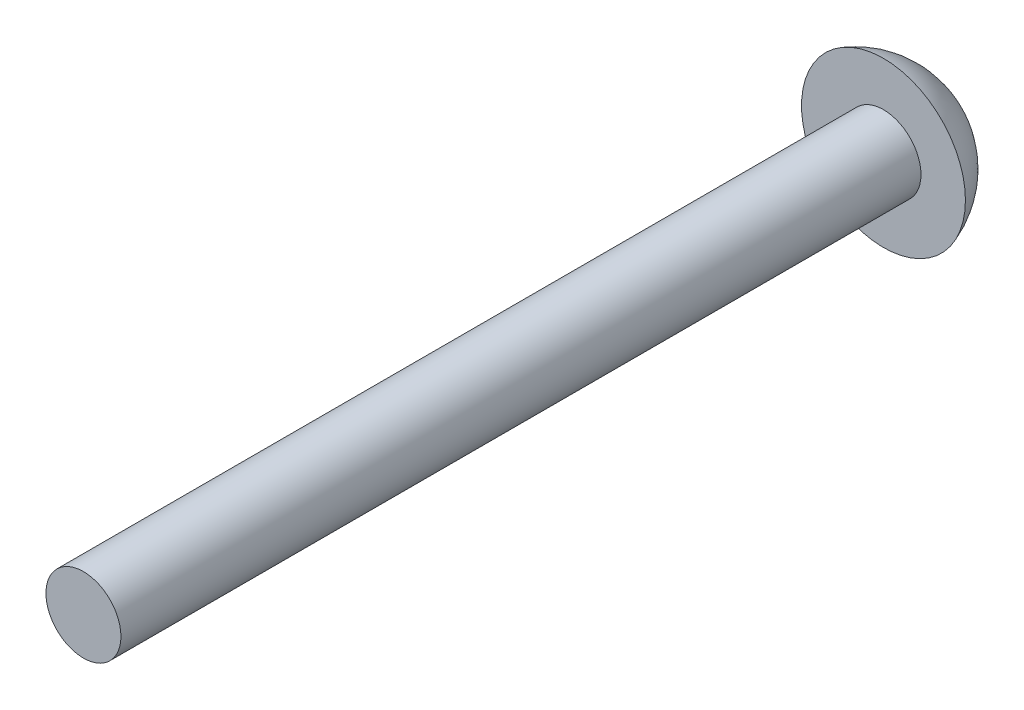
from build123d import *

# Parameters (mm, degrees)
SKETCH1_R           = 0.75
BOSS_EXTRUDE1_DEPTH = 16


with BuildPart() as part:
    # Sketch1 → Boss-Extrude1 (new body)
    with BuildSketch(Plane.XY):
        Circle(SKETCH1_R)
    extrude(amount=BOSS_EXTRUDE1_DEPTH)

    # Sketch2 → Revolve1 (revolve)
    with BuildSketch(Plane(origin=(0, 0, 0), x_dir=(1, 0, 0), z_dir=(0, 1, 0))):
        with BuildLine():
            Line((0, 0), (1.639140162, 0))
            ThreePointArc((1.639140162, 0), (1.008027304, 0.850056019), (0, 1.173752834))
            Line((0, 1.173752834), (0, 0))
        make_face()
    revolve(axis=Axis((0, 0, 0), (0, 0, -1)))


solid = part.part
